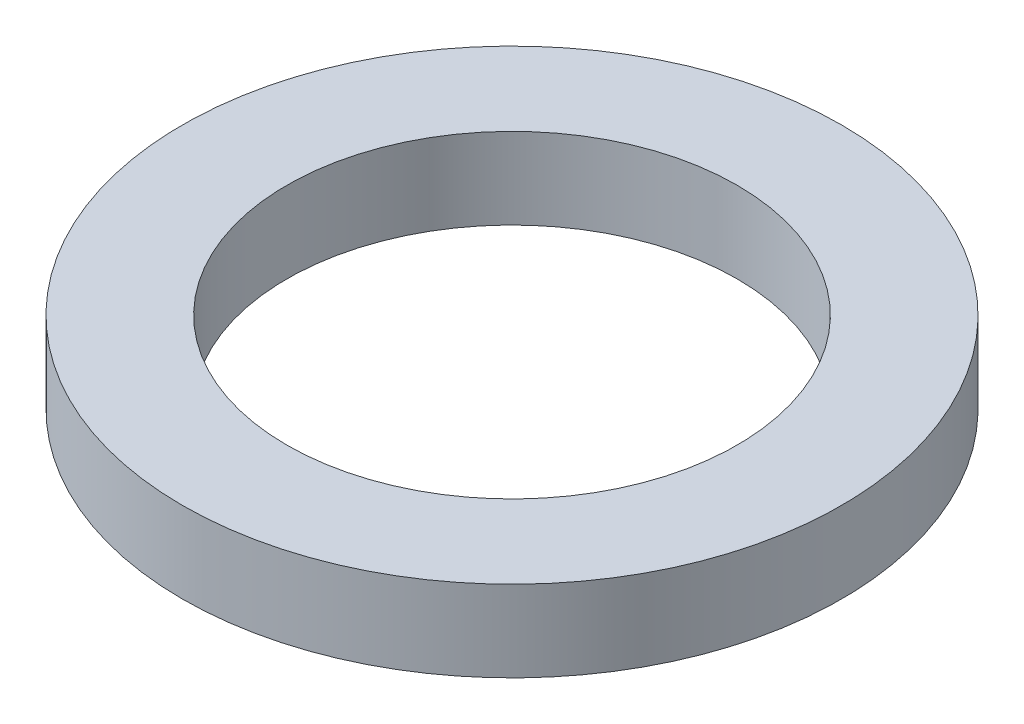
from build123d import *


with BuildPart() as part:
    # Sketch 2 → Revolve 1 (revolve)
    with BuildSketch(Plane(origin=(0, 0, 0), x_dir=(0, 0, -1), z_dir=(1, 0, 0)), mode=Mode.PRIVATE) as revolve_1_sk:
        Polygon((16.25, -4), (13.675, -1.83931845), (11.1, -4), (11.1, 0), (16.25, 0), align=None)
    revolve(revolve_1_sk.sketch.rotate(Axis((0, 2.006421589, 0), (0, -1, 0)), 180), axis=Axis((0, 2.006421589, 0), (0, -1, 0)))


solid = part.part
